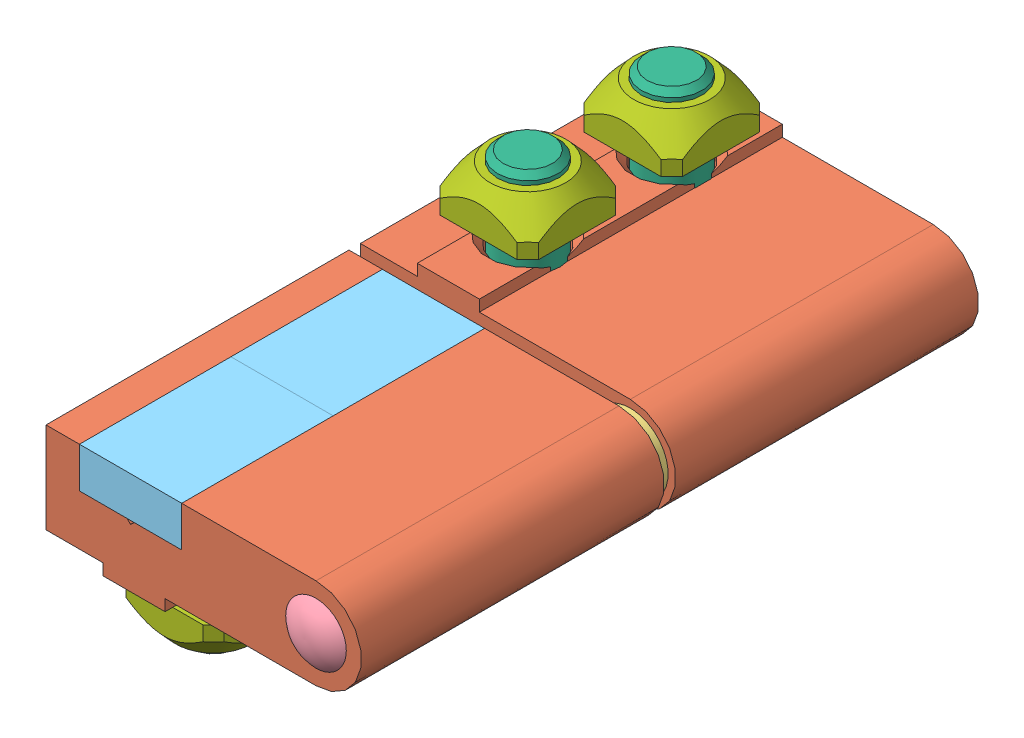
SolidWorks assembly 21.1096 HINGE 45 LEFT HAND.SLDASM, configuration Default (file format 3800). Lengths in mm.
Overall size (42.18 34.64 84.51).
18 component instances, 7 part files, 38 mates.
Components (placement in the parent):
- 21.1096 HINGE PIN-1: 21.1096 HINGE PIN.SLDPRT [Default] at origin size (6.07 6.07 65)
- 21.1096 HINGE 45 AL BLOCK-1: 21.1096 HINGE 45 AL BLOCK.SLDPRT [Default] at (-24.5 6 31.75) x (-1 0 0) z (0 0 1) size (41.65 13.5 40)
- 21.1096 HINGE 45 AL BLOCK-2: 21.1096 HINGE 45 AL BLOCK.SLDPRT [Default] at (-24.5 -6 33.25) x (-1 0 0) z (0 0 -1) size (41.65 13.5 40)
- 21.1096 HINGE WASHER-1: 21.1096 HINGE WASHER.SLDPRT [Default] at (0 0 33.25) x (-0.923728 -0.383049 0) z (0 0 -1) size (10 10 1.5)
- 21.1096 HINGE PIN END CAP-1: 21.1096 HINGE PIN END CAP.SLDPRT [Default] at (0 0 -9.75) x (1 0 0) z (0 1 0) size (8 7 8)
- 21.1096 HINGE PIN END CAP-2: 21.1096 HINGE PIN END CAP.SLDPRT [Default] at (0 0 74.75) x (1 0 0) z (0 -1 0) size (8 7 8)
- 22.1050 HINGE SCREW CAP-1: 22.1050 HINGE SCREW CAP.SLDPRT [Default] at (-17.7316 -6 1.75) x (0 0 -1) z (-1 0 0) size (20 5.34 13.5)
- 22.1050 HINGE SCREW CAP-2: 22.1050 HINGE SCREW CAP.SLDPRT [Default] at (-17.7316 -6 21.75) x (0 0 -1) z (-1 0 0) size (20 5.34 13.5)
- 22.1050 HINGE SCREW CAP-3: 22.1050 HINGE SCREW CAP.SLDPRT [Default] at (-17.7316 6 43.25) x (0 0 1) z (-1 0 0) size (20 5.34 13.5)
- 22.1050 HINGE SCREW CAP-4: 22.1050 HINGE SCREW CAP.SLDPRT [Default] at (-31.2316 6 63.25) x (0 0 -1) z (1 0 0) size (20 5.34 13.5)
- 21.1268 M8X18-1: 21.1268 M8X18.SLDPRT [Default] at (-24.0292 -0.6971 2.25) x (0 1 0) z (0 0 1) size (23 13 13)
- 21.1268 M8X18-2: 21.1268 M8X18.SLDPRT [Default] at (-24.0292 0.6603 62.75) x (0 -1 0) z (0 0 1) size (23 13 13)
- 21.1268 M8X18-3: 21.1268 M8X18.SLDPRT [Default] at (-24.0292 -0.6971 21.25) x (0 1 0) z (0 0 1) size (23 13 13)
- 21.1268 M8X18-4: 21.1268 M8X18.SLDPRT [Default] at (-24.0292 0.6603 43.75) x (0 -1 0) z (0 0 1) size (23 13 13)
- 21.1351 M8 SQUARE NUT-1: 21.1351 M8 SQUARE NUT.SLDPRT [Default] at (-24.0292 -10.5 62.75) x (1 0 0) z (0 1 0) size (13 13 5.5)
- 21.1351 M8 SQUARE NUT-2: 21.1351 M8 SQUARE NUT.SLDPRT [Default] at (-24.0292 -10.5 43.75) x (1 0 0) z (0 1 0) size (13 13 5.5)
- 21.1351 M8 SQUARE NUT-3: 21.1351 M8 SQUARE NUT.SLDPRT [Default] at (-24.0292 10.5 21.25) x (1 0 0) z (0 -1 0) size (13 13 5.5)
- 21.1351 M8 SQUARE NUT-4: 21.1351 M8 SQUARE NUT.SLDPRT [Default] at (-24.0292 10.5 2.25) x (1 0 0) z (0 -1 0) size (13 13 5.5)
Mates (geometry in assembly coordinates):
- Coincident1: coincident anti-aligned: axis of 21.1096 HINGE PIN-1; axis of 21.1096 HINGE 45 AL BLOCK-1
- Distance1: distance = 33.25 mm aligned: plane of 21.1096 HINGE PIN-1 through (0 0 65) normal (0 0 1); plane of 21.1096 HINGE 45 AL BLOCK-1 through (-17.0063 0.593 31.75) normal (0 0 1)
- Coincident3: coincident anti-aligned: plane of 21.1096 HINGE WASHER-1 through (0 0 31.75) normal (0 0 -1); plane of 21.1096 HINGE 45 AL BLOCK-1 through (-17.0063 0.593 31.75) normal (0 0 1)
- Coincident4: coincident anti-aligned: axis of 21.1096 HINGE PIN-1; axis of 21.1096 HINGE WASHER-1
- Coincident5: coincident aligned: axis of 21.1096 HINGE 45 AL BLOCK-2; axis of 21.1096 HINGE PIN-1
- Coincident6: coincident anti-aligned: plane of 21.1096 HINGE 45 AL BLOCK-2 through (-17.0063 -0.593 33.25) normal (0 0 -1); plane of 21.1096 HINGE WASHER-1 through (0 0 33.25) normal (0 0 1)
- Coincident7: coincident anti-aligned: plane of 21.1096 HINGE 45 AL BLOCK-2 through (-17.0063 -0.593 73.25) normal (0 0 1); plane of 21.1096 HINGE PIN END CAP-2 through (3.55 0 73.25) normal (0 0 -1)
- Coincident8: coincident anti-aligned: axis of 21.1096 HINGE PIN-1; axis of 21.1096 HINGE PIN END CAP-2
- Coincident9: coincident anti-aligned: plane of 21.1096 HINGE 45 AL BLOCK-1 through (-17.0063 0.593 -8.25) normal (0 0 -1); plane of 21.1096 HINGE PIN END CAP-1 through (3.55 0 -8.25) normal (0 0 1)
- Coincident10: coincident anti-aligned: axis of 21.1096 HINGE 45 AL BLOCK-1; axis of 21.1096 HINGE PIN END CAP-1
- Coincident11: coincident aligned: plane of 22.1050 HINGE SCREW CAP-1 through (-17.7316 -6 -8.25) normal (0 0 -1); plane of 21.1096 HINGE 45 AL BLOCK-1 through (-17.0063 0.593 -8.25) normal (0 0 -1)
- Coincident12: coincident aligned: plane of 21.1096 HINGE 45 AL BLOCK-1 through (-17.7316 -6 31.75) normal (0 -1 0); plane of 22.1050 HINGE SCREW CAP-1 through (-17.7316 -6 11.75) normal (0 -1 0)
- Coincident13: coincident anti-aligned: plane of 21.1096 HINGE 45 AL BLOCK-1 through (-17.7316 -0.6603 31.75) normal (-1 0 0); plane of 22.1050 HINGE SCREW CAP-1 through (-17.7316 -4.4369 1.75) normal (1 0 0)
- Coincident14: coincident aligned: plane of 22.1050 HINGE SCREW CAP-2 through (-17.7316 -0.66 31.75) normal (0 0 1); plane of 21.1096 HINGE 45 AL BLOCK-1 through (-17.0063 0.593 31.75) normal (0 0 1)
- Coincident15: coincident aligned: plane of 21.1096 HINGE 45 AL BLOCK-1 through (-17.7316 -6 31.75) normal (0 -1 0); plane of 22.1050 HINGE SCREW CAP-2 through (-17.7316 -6 31.75) normal (0 -1 0)
- Coincident16: coincident anti-aligned: plane of 21.1096 HINGE 45 AL BLOCK-1 through (-31.2316 -6 31.75) normal (1 0 0); plane of 22.1050 HINGE SCREW CAP-2 through (-31.2316 -4.4369 21.75) normal (-1 0 0)
- Coincident17: coincident aligned: plane of 22.1050 HINGE SCREW CAP-4 through (-31.2316 0.66 73.25) normal (0 0 1); plane of 21.1096 HINGE 45 AL BLOCK-2 through (-17.0063 -0.593 73.25) normal (0 0 1)
- Coincident18: coincident anti-aligned: plane of 21.1096 HINGE 45 AL BLOCK-2 through (-31.2316 6 33.25) normal (1 0 0); plane of 22.1050 HINGE SCREW CAP-4 through (-31.2316 4.4369 63.25) normal (-1 0 0)
- Coincident19: coincident aligned: plane of 21.1096 HINGE 45 AL BLOCK-2 through (-17.7316 6 33.25) normal (0 1 0); plane of 22.1050 HINGE SCREW CAP-4 through (-31.2316 6 73.25) normal (0 1 0)
- Coincident20: coincident aligned: plane of 21.1096 HINGE 45 AL BLOCK-2 through (-17.7316 6 33.25) normal (0 1 0); plane of 22.1050 HINGE SCREW CAP-3 through (-17.7316 6 33.25) normal (0 1 0)
- Coincident21: coincident anti-aligned: plane of 22.1050 HINGE SCREW CAP-3 through (-17.7316 6 53.25) normal (0 0 1); plane of 22.1050 HINGE SCREW CAP-4 through (-31.2316 6 53.25) normal (0 0 -1)
- Coincident22: coincident anti-aligned: plane of 21.1096 HINGE 45 AL BLOCK-2 through (-17.7316 0.6603 33.25) normal (-1 0 0); plane of 22.1050 HINGE SCREW CAP-3 through (-17.7316 4.4369 43.25) normal (1 0 0)
- Coincident23: coincident anti-aligned: axis of 21.1096 HINGE 45 AL BLOCK-1; axis of 21.1268 M8X18-1
- Coincident24: coincident anti-aligned: plane of 21.1096 HINGE 45 AL BLOCK-1 through (-31.2316 -0.6971 31.75) normal (0 -1 0); plane of 21.1268 M8X18-1 through (-29.2792 -0.6971 2.25) normal (0 1 0)
- Coincident25: coincident anti-aligned: axis of 21.1096 HINGE 45 AL BLOCK-1; axis of 21.1268 M8X18-3
- Coincident26: coincident anti-aligned: plane of 21.1096 HINGE 45 AL BLOCK-1 through (-31.2316 -0.6971 31.75) normal (0 -1 0); plane of 21.1268 M8X18-3 through (-29.2792 -0.6971 21.25) normal (0 1 0)
- Coincident27: coincident anti-aligned: axis of 21.1096 HINGE 45 AL BLOCK-2; axis of 21.1268 M8X18-4
- Coincident28: coincident anti-aligned: plane of 21.1096 HINGE 45 AL BLOCK-2 through (-24 0.6603 33.25) normal (0 1 0); plane of 21.1268 M8X18-4 through (-18.7792 0.6603 43.75) normal (0 -1 0)
- Coincident29: coincident anti-aligned: axis of 21.1096 HINGE 45 AL BLOCK-2; axis of 21.1268 M8X18-2
- Coincident30: coincident anti-aligned: plane of 21.1096 HINGE 45 AL BLOCK-2 through (-24 0.6603 33.25) normal (0 1 0); circle of 21.1268 M8X18-2
- Coincident31: coincident aligned: axis of 21.1351 M8 SQUARE NUT-4; axis of 21.1268 M8X18-1
- Coincident32: coincident aligned: axis of ?; axis of 21.1268 M8X18-3
- Coincident33: coincident aligned: axis of 21.1351 M8 SQUARE NUT-1; axis of 21.1268 M8X18-2
- Coincident34: coincident aligned: axis of 21.1268 M8X18-4; axis of 21.1351 M8 SQUARE NUT-2
- Distance2: distance = 4.5 mm anti-aligned: plane of 21.1351 M8 SQUARE NUT-1 through (-24.0292 -10.5 62.75) normal (0 1 0); plane of 21.1096 HINGE 45 AL BLOCK-2 through (-28.1292 -6 33.25) normal (0 -1 0)
- Distance3: distance = 4.5 mm anti-aligned: plane of 21.1351 M8 SQUARE NUT-2 through (-24.0292 -10.5 43.75) normal (0 1 0); plane of 21.1096 HINGE 45 AL BLOCK-2 through (0 -6 33.25) normal (0 -1 0)
- Distance4: distance = 4.5 mm anti-aligned: plane of 21.1351 M8 SQUARE NUT-4 through (-24.0292 10.5 2.25) normal (0 -1 0); plane of 21.1096 HINGE 45 AL BLOCK-1 through (0 6 31.75) normal (0 1 0)
- Distance5: distance = 4.5 mm anti-aligned: plane of 21.1096 HINGE 45 AL BLOCK-1 through (0 6 31.75) normal (0 1 0); plane of 21.1351 M8 SQUARE NUT-3 through (-24.0292 10.5 21.25) normal (0 -1 0)
